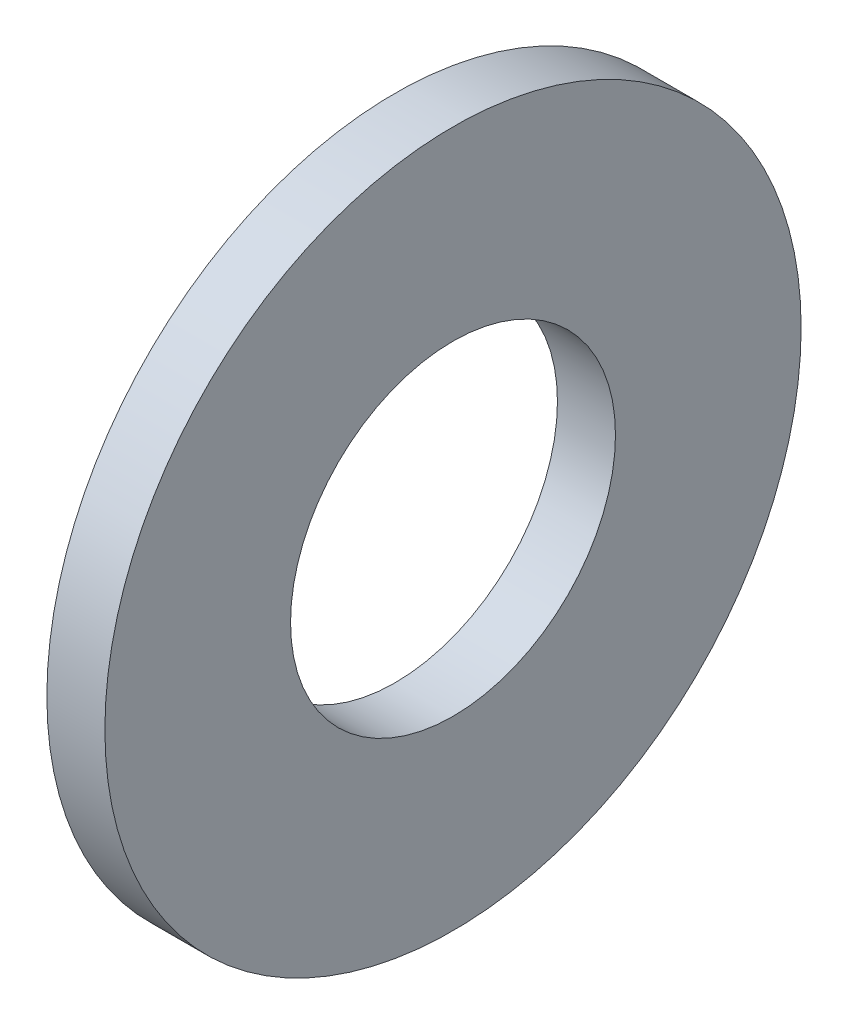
ISO-10303-21;
HEADER;
FILE_DESCRIPTION(('STEP AP214'),'2;1');
FILE_NAME('part.step','',(''),(''),'','','');
FILE_SCHEMA(('AUTOMOTIVE_DESIGN { 1 0 10303 214 1 1 1 1 }'));
ENDSEC;
DATA;
#1=APPLICATION_CONTEXT('core data for automotive mechanical design processes');
#2=APPLICATION_PROTOCOL_DEFINITION('international standard','automotive_design',2000,#1);
#3=PRODUCT_CONTEXT('',#1,'mechanical');
#4=PRODUCT('Part','Part','',(#3));
#5=PRODUCT_RELATED_PRODUCT_CATEGORY('part','',(#4));
#6=PRODUCT_DEFINITION_FORMATION('','',#4);
#7=PRODUCT_DEFINITION_CONTEXT('part definition',#1,'design');
#8=PRODUCT_DEFINITION('design','',#6,#7);
#9=PRODUCT_DEFINITION_SHAPE('','',#8);
#10=(LENGTH_UNIT() NAMED_UNIT(*) SI_UNIT(.MILLI.,.METRE.));
#11=(NAMED_UNIT(*) PLANE_ANGLE_UNIT() SI_UNIT($,.RADIAN.));
#12=(NAMED_UNIT(*) SI_UNIT($,.STERADIAN.) SOLID_ANGLE_UNIT());
#13=UNCERTAINTY_MEASURE_WITH_UNIT(LENGTH_MEASURE(1.E-05),#10,'distance_accuracy_value','');
#14=(GEOMETRIC_REPRESENTATION_CONTEXT(3) GLOBAL_UNCERTAINTY_ASSIGNED_CONTEXT((#13)) GLOBAL_UNIT_ASSIGNED_CONTEXT((#10,
#11,#12)) REPRESENTATION_CONTEXT('',''));
#15=CARTESIAN_POINT('',(0.,0.,0.));
#16=DIRECTION('',(0.,0.,1.));
#17=DIRECTION('',(1.,0.,0.));
#18=AXIS2_PLACEMENT_3D('',#15,#16,#17);
#19=CARTESIAN_POINT('',(0.,0.,-9.));
#20=DIRECTION('',(1.,0.,0.));
#21=DIRECTION('',(0.,0.,-1.));
#22=AXIS2_PLACEMENT_3D('',#19,#20,#21);
#23=PLANE('',#22);
#24=CARTESIAN_POINT('',(0.,0.,0.));
#25=DIRECTION('',(-1.,0.,0.));
#26=DIRECTION('',(0.,0.,1.));
#27=AXIS2_PLACEMENT_3D('',#24,#25,#26);
#28=CIRCLE('',#27,4.2);
#29=CARTESIAN_POINT('',(0.,0.,4.2));
#30=VERTEX_POINT('',#29);
#31=EDGE_CURVE('E10',#30,#30,#28,.T.);
#32=ORIENTED_EDGE('',*,*,#31,.F.);
#33=EDGE_LOOP('',(#32));
#34=FACE_BOUND('',#33,.T.);
#35=CARTESIAN_POINT('',(0.,0.,0.));
#36=DIRECTION('',(-1.,0.,0.));
#37=DIRECTION('',(0.,0.,1.));
#38=AXIS2_PLACEMENT_3D('',#35,#36,#37);
#39=CIRCLE('',#38,9.);
#40=CARTESIAN_POINT('',(0.,0.,9.));
#41=VERTEX_POINT('',#40);
#42=EDGE_CURVE('E43',#41,#41,#39,.T.);
#43=ORIENTED_EDGE('',*,*,#42,.T.);
#44=EDGE_LOOP('',(#43));
#45=FACE_BOUND('',#44,.T.);
#46=ADVANCED_FACE('F29',(#34,#45),#23,.F.);
#47=CARTESIAN_POINT('',(0.,0.,0.));
#48=DIRECTION('',(-1.,0.,0.));
#49=DIRECTION('',(0.,0.,1.));
#50=AXIS2_PLACEMENT_3D('',#47,#48,#49);
#51=CYLINDRICAL_SURFACE('',#50,4.2);
#52=CARTESIAN_POINT('',(1.5,0.,0.));
#53=DIRECTION('',(-1.,0.,0.));
#54=DIRECTION('',(0.,0.,1.));
#55=AXIS2_PLACEMENT_3D('',#52,#53,#54);
#56=CIRCLE('',#55,4.2);
#57=CARTESIAN_POINT('',(1.5,0.,4.2));
#58=VERTEX_POINT('',#57);
#59=EDGE_CURVE('E35',#58,#58,#56,.T.);
#60=ORIENTED_EDGE('',*,*,#59,.F.);
#61=EDGE_LOOP('',(#60));
#62=FACE_BOUND('',#61,.T.);
#63=ORIENTED_EDGE('',*,*,#31,.T.);
#64=EDGE_LOOP('',(#63));
#65=FACE_BOUND('',#64,.T.);
#66=ADVANCED_FACE('F58',(#62,#65),#51,.F.);
#67=CARTESIAN_POINT('',(1.5,0.,-9.));
#68=DIRECTION('',(-1.,0.,0.));
#69=DIRECTION('',(0.,0.,1.));
#70=AXIS2_PLACEMENT_3D('',#67,#68,#69);
#71=PLANE('',#70);
#72=CARTESIAN_POINT('',(1.5,0.,0.));
#73=DIRECTION('',(-1.,0.,0.));
#74=DIRECTION('',(0.,0.,1.));
#75=AXIS2_PLACEMENT_3D('',#72,#73,#74);
#76=CIRCLE('',#75,9.);
#77=CARTESIAN_POINT('',(1.5,0.,9.));
#78=VERTEX_POINT('',#77);
#79=EDGE_CURVE('E39',#78,#78,#76,.T.);
#80=ORIENTED_EDGE('',*,*,#79,.F.);
#81=EDGE_LOOP('',(#80));
#82=FACE_BOUND('',#81,.T.);
#83=ORIENTED_EDGE('',*,*,#59,.T.);
#84=EDGE_LOOP('',(#83));
#85=FACE_BOUND('',#84,.T.);
#86=ADVANCED_FACE('F53',(#82,#85),#71,.F.);
#87=CARTESIAN_POINT('',(0.,0.,0.));
#88=DIRECTION('',(-1.,0.,0.));
#89=DIRECTION('',(0.,0.,1.));
#90=AXIS2_PLACEMENT_3D('',#87,#88,#89);
#91=CYLINDRICAL_SURFACE('',#90,9.);
#92=ORIENTED_EDGE('',*,*,#42,.F.);
#93=EDGE_LOOP('',(#92));
#94=FACE_BOUND('',#93,.T.);
#95=ORIENTED_EDGE('',*,*,#79,.T.);
#96=EDGE_LOOP('',(#95));
#97=FACE_BOUND('',#96,.T.);
#98=ADVANCED_FACE('F50',(#94,#97),#91,.T.);
#99=CLOSED_SHELL('',(#46,#66,#86,#98));
#100=MANIFOLD_SOLID_BREP('B2',#99);
#101=ADVANCED_BREP_SHAPE_REPRESENTATION('',(#18,#100),#14);
#102=SHAPE_DEFINITION_REPRESENTATION(#9,#101);
ENDSEC;
END-ISO-10303-21;
